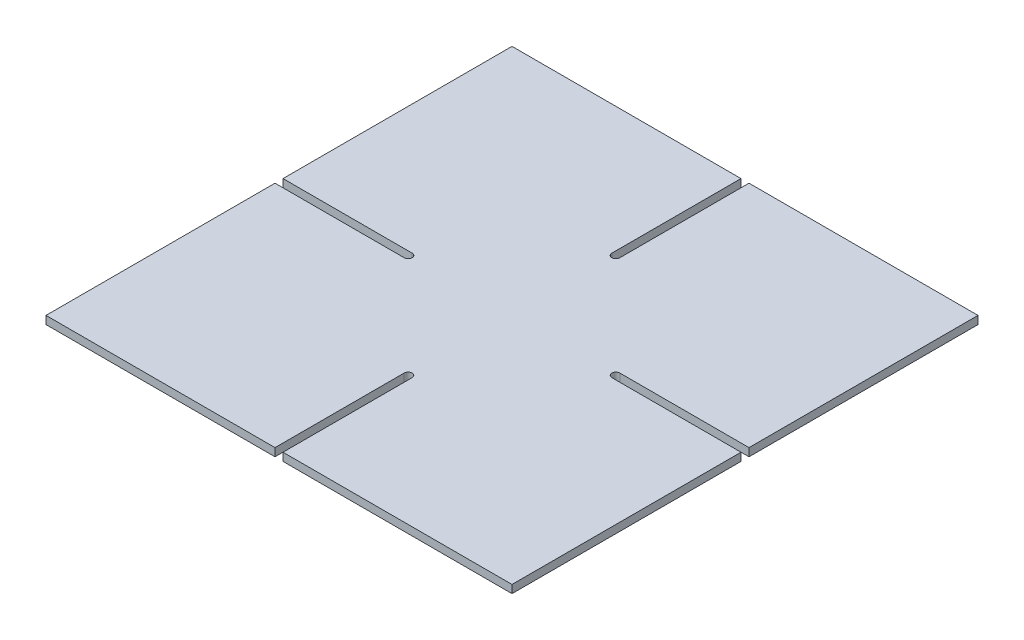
from build123d import *

# Parameters (mm, degrees)
CROQUIS1_W              = 350
CROQUIS1_H              = 350
SALIENTE_EXTRUIR1_DEPTH = 6
CORTAR_EXTRUIR1_DEPTH   = 40


with BuildPart() as part:
    # Croquis1 → Saliente-Extruir1 (new body)
    with BuildSketch(Plane(origin=(0, 0, 0), x_dir=(1, 0, 0), z_dir=(0, 1, 0))):
        Rectangle(CROQUIS1_W, CROQUIS1_H)
    extrude(amount=SALIENTE_EXTRUIR1_DEPTH)

    # Croquis2 → Cortar-Extruir1 (cut)
    with BuildSketch(Plane(origin=(0, 6, 0), x_dir=(1, 0, 0), z_dir=(0, 1, 0))):
        with BuildLine():
            Line((-3, 175), (-3, 78))
            ThreePointArc((-3, 78), (0, 75), (3, 78))
            Line((3, 78), (3, 175))
            Line((3, 175), (-3, 175))
        make_face()
        with BuildLine():
            Line((-175, -3), (-78, -3))
            ThreePointArc((-78, -3), (-75, 0), (-78, 3))
            Line((-78, 3), (-175, 3))
            Line((-175, 3), (-175, -3))
        make_face()
        with BuildLine():
            Line((175, 3), (78, 3))
            ThreePointArc((78, 3), (75, 0), (78, -3))
            Line((78, -3), (175, -3))
            Line((175, -3), (175, 3))
        make_face()
        with BuildLine():
            Line((3, -175), (3, -78))
            ThreePointArc((3, -78), (0, -75), (-3, -78))
            Line((-3, -78), (-3, -175))
            Line((-3, -175), (3, -175))
        make_face()
    extrude(amount=-CORTAR_EXTRUIR1_DEPTH, mode=Mode.SUBTRACT)


solid = part.part
